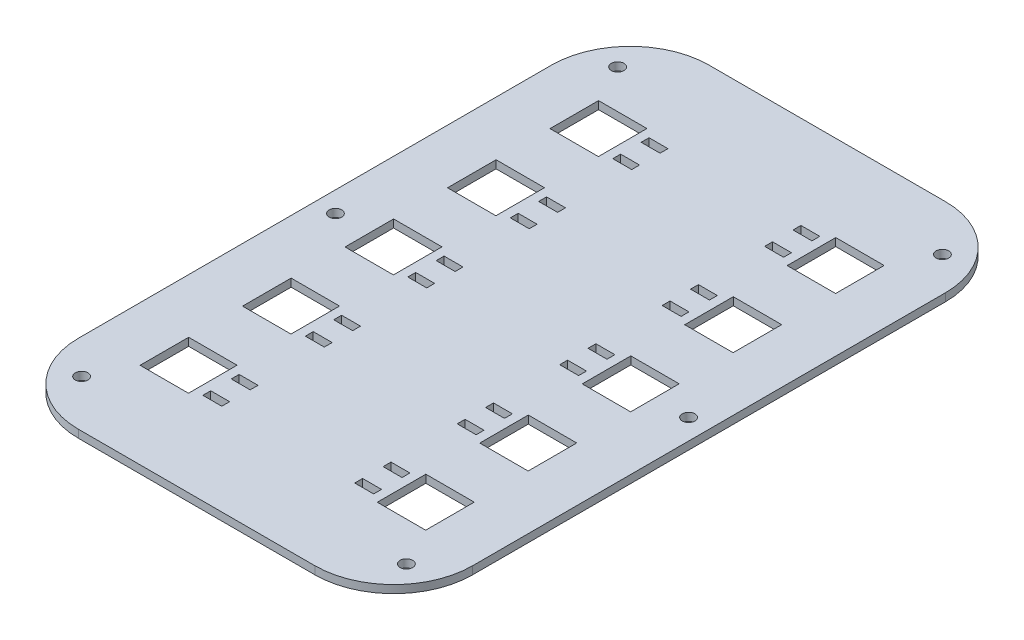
from build123d import *

# Parameters (mm, degrees)
BOSS_EXTRUDE1_DEPTH = 5
SKETCH3_W           = 30.7
SKETCH3_H           = 30.8
SKETCH3_W_2         = 30.3
SKETCH3_H_2         = 30.4
CUT_EXTRUDE1_DEPTH  = 10
LPATTERN1_COUNT     = 5
LPATTERN1_PITCH     = 65
SKETCH4_W           = 12
SKETCH4_H           = 5
CUT_EXTRUDE2_DEPTH  = 10
LPATTERN2_COUNT     = 5
LPATTERN2_PITCH     = 65
SKETCH5_R           = 4
CUT_EXTRUDE3_DEPTH  = 5


with BuildPart() as part:
    # Sketch1 → Boss-Extrude1 (new body)
    with BuildSketch(Plane(origin=(0, 0, 0), x_dir=(1, 0, 0), z_dir=(0, 1, 0))):
        with BuildLine():
            Line((-75, 200), (75, 200))
            ThreePointArc((75, 200), (110.355339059, 185.355339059), (125, 150))
            Line((125, 150), (125, -150))
            ThreePointArc((125, -150), (110.355339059, -185.355339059), (75, -200))
            Line((75, -200), (-75, -200))
            ThreePointArc((-75, -200), (-110.355339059, -185.355339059), (-125, -150))
            Line((-125, -150), (-125, 150))
            ThreePointArc((-125, 150), (-110.355339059, 185.355339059), (-75, 200))
        make_face()
    extrude(amount=BOSS_EXTRUDE1_DEPTH)

    # Sketch3 → Cut-Extrude1 (cut)
    # profile 1 of 4: a face of its own
    with BuildSketch(Plane.XZ):
        with Locations((-75.225, 129.928570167)):
            Rectangle(SKETCH3_W, SKETCH3_H)
        with Locations((-75.225, 129.928570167)):
            Rectangle(SKETCH3_W_2, SKETCH3_H_2, mode=Mode.SUBTRACT)
    # profile 2 of 4: a face of its own
    with BuildSketch(Plane.XZ):
        with Locations((-75.225, 129.928570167)):
            Rectangle(SKETCH3_W_2, SKETCH3_H_2)
    # profile 3 of 4: a face of its own
    with BuildSketch(Plane.XZ):
        with Locations((75.225, 129.928570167)):
            Rectangle(SKETCH3_W, SKETCH3_H)
        with Locations((75.225, 129.928570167)):
            Rectangle(SKETCH3_W_2, SKETCH3_H_2, mode=Mode.SUBTRACT)
    # profile 4 of 4: a face of its own
    with BuildSketch(Plane.XZ):
        with Locations((75.225, 129.928570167)):
            Rectangle(SKETCH3_W_2, SKETCH3_H_2)
    cut_extrude1 = extrude(amount=-CUT_EXTRUDE1_DEPTH, mode=Mode.SUBTRACT)

    # LPattern1: Cut-Extrude1 ×5
    with Locations(*[(0, 0, -i * LPATTERN1_PITCH) for i in range(1, LPATTERN1_COUNT)]):
        add(cut_extrude1, mode=Mode.SUBTRACT)

    # Sketch4 → Cut-Extrude2 (cut)
    with BuildSketch(Plane(origin=(0, 5, 0), x_dir=(1, 0, 0), z_dir=(0, 1, 0))):
        with Locations((-48.165, -139.42)):
            Rectangle(SKETCH4_W, SKETCH4_H)
        with Locations((-48.165, -121.42)):
            Rectangle(SKETCH4_W, SKETCH4_H)
        with Locations((48.165, -139.42)):
            Rectangle(SKETCH4_W, SKETCH4_H)
        with Locations((48.165, -121.42)):
            Rectangle(SKETCH4_W, SKETCH4_H)
    cut_extrude2 = extrude(amount=-CUT_EXTRUDE2_DEPTH, mode=Mode.SUBTRACT)

    # LPattern2: Cut-Extrude2 ×5
    with Locations(*[(0, 0, -i * LPATTERN2_PITCH) for i in range(1, LPATTERN2_COUNT)]):
        add(cut_extrude2, mode=Mode.SUBTRACT)

    # Sketch5 → Cut-Extrude3 (cut)
    with BuildSketch(Plane(origin=(0, 5, 0), x_dir=(1, 0, 0), z_dir=(0, 1, 0))):
        with Locations(Location((-103, 170, 0), (0, 0, 270))):
            Circle(SKETCH5_R)
        with Locations(Location((103, 170, 0), (0, 0, 270))):
            Circle(SKETCH5_R)
        with Locations(Location((103, -170, 0), (0, 0, 270))):
            Circle(SKETCH5_R)
        with Locations(Location((-103, -170, 0), (0, 0, 270))):
            Circle(SKETCH5_R)
        with Locations(Location((-112, 0, 0), (0, 0, 270))):
            Circle(SKETCH5_R)
        with Locations(Location((112, 0, 0), (0, 0, 270))):
            Circle(SKETCH5_R)
    extrude(amount=-CUT_EXTRUDE3_DEPTH, mode=Mode.SUBTRACT)


solid = part.part
